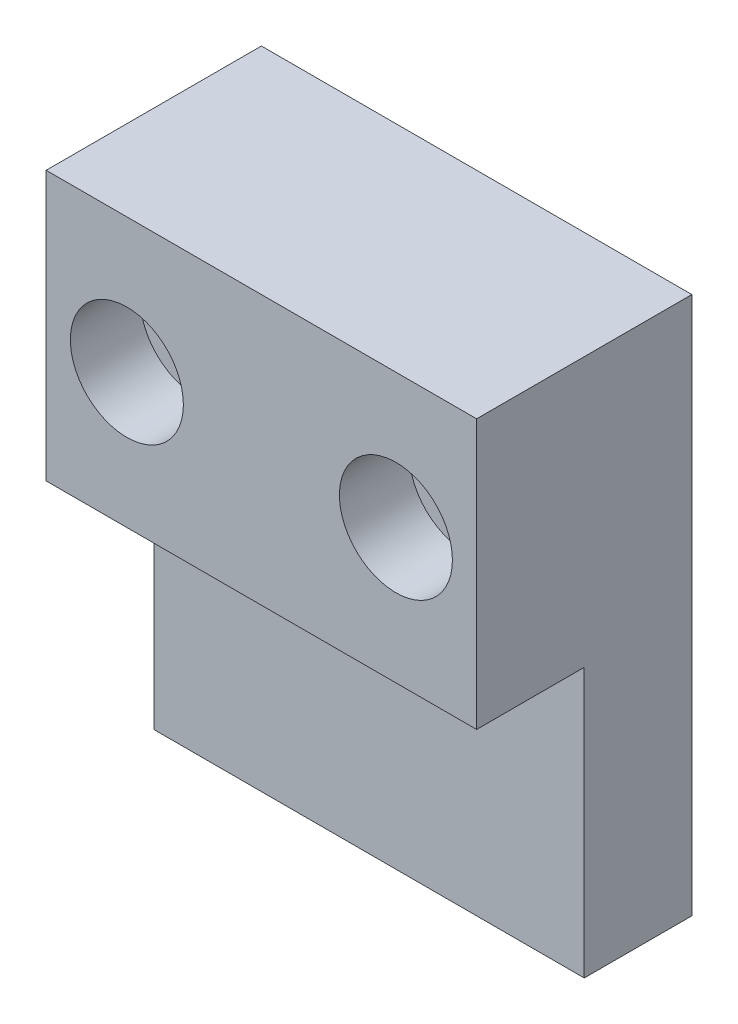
ISO-10303-21;
HEADER;
FILE_DESCRIPTION(('STEP AP214'),'2;1');
FILE_NAME('part.step','',(''),(''),'','','');
FILE_SCHEMA(('AUTOMOTIVE_DESIGN { 1 0 10303 214 1 1 1 1 }'));
ENDSEC;
DATA;
#1=APPLICATION_CONTEXT('core data for automotive mechanical design processes');
#2=APPLICATION_PROTOCOL_DEFINITION('international standard','automotive_design',2000,#1);
#3=PRODUCT_CONTEXT('',#1,'mechanical');
#4=PRODUCT('Part','Part','',(#3));
#5=PRODUCT_RELATED_PRODUCT_CATEGORY('part','',(#4));
#6=PRODUCT_DEFINITION_FORMATION('','',#4);
#7=PRODUCT_DEFINITION_CONTEXT('part definition',#1,'design');
#8=PRODUCT_DEFINITION('design','',#6,#7);
#9=PRODUCT_DEFINITION_SHAPE('','',#8);
#10=(LENGTH_UNIT() NAMED_UNIT(*) SI_UNIT(.MILLI.,.METRE.));
#11=(NAMED_UNIT(*) PLANE_ANGLE_UNIT() SI_UNIT($,.RADIAN.));
#12=(NAMED_UNIT(*) SI_UNIT($,.STERADIAN.) SOLID_ANGLE_UNIT());
#13=UNCERTAINTY_MEASURE_WITH_UNIT(LENGTH_MEASURE(1.E-05),#10,'distance_accuracy_value','');
#14=(GEOMETRIC_REPRESENTATION_CONTEXT(3) GLOBAL_UNCERTAINTY_ASSIGNED_CONTEXT((#13)) GLOBAL_UNIT_ASSIGNED_CONTEXT((#10,
#11,#12)) REPRESENTATION_CONTEXT('',''));
#15=CARTESIAN_POINT('',(0.,0.,0.));
#16=DIRECTION('',(0.,0.,1.));
#17=DIRECTION('',(1.,0.,0.));
#18=AXIS2_PLACEMENT_3D('',#15,#16,#17);
#19=CARTESIAN_POINT('',(7.5,37.5,20.));
#20=DIRECTION('',(0.,0.,1.));
#21=DIRECTION('',(1.,0.,0.));
#22=AXIS2_PLACEMENT_3D('',#19,#20,#21);
#23=CYLINDRICAL_SURFACE('',#22,3.25);
#24=CARTESIAN_POINT('',(7.5,37.5,13.5));
#25=DIRECTION('',(0.,0.,1.));
#26=DIRECTION('',(1.,0.,0.));
#27=AXIS2_PLACEMENT_3D('',#24,#25,#26);
#28=CIRCLE('',#27,3.25);
#29=CARTESIAN_POINT('',(10.75,37.5,13.5));
#30=VERTEX_POINT('',#29);
#31=EDGE_CURVE('E110',#30,#30,#28,.T.);
#32=ORIENTED_EDGE('',*,*,#31,.T.);
#33=EDGE_LOOP('',(#32));
#34=FACE_BOUND('',#33,.T.);
#35=CARTESIAN_POINT('',(7.5,37.5,5.));
#36=DIRECTION('',(0.,0.,-1.));
#37=DIRECTION('',(-1.,0.,0.));
#38=AXIS2_PLACEMENT_3D('',#35,#36,#37);
#39=CIRCLE('',#38,3.25);
#40=CARTESIAN_POINT('',(4.25,37.5,5.));
#41=VERTEX_POINT('',#40);
#42=EDGE_CURVE('E35',#41,#41,#39,.F.);
#43=ORIENTED_EDGE('',*,*,#42,.F.);
#44=EDGE_LOOP('',(#43));
#45=FACE_BOUND('',#44,.T.);
#46=ADVANCED_FACE('F31',(#34,#45),#23,.F.);
#47=CARTESIAN_POINT('',(32.5,37.5,20.));
#48=DIRECTION('',(0.,0.,1.));
#49=DIRECTION('',(1.,0.,0.));
#50=AXIS2_PLACEMENT_3D('',#47,#48,#49);
#51=CYLINDRICAL_SURFACE('',#50,3.25);
#52=CARTESIAN_POINT('',(32.5,37.5,13.5));
#53=DIRECTION('',(0.,0.,1.));
#54=DIRECTION('',(1.,0.,0.));
#55=AXIS2_PLACEMENT_3D('',#52,#53,#54);
#56=CIRCLE('',#55,3.25);
#57=CARTESIAN_POINT('',(35.75,37.5,13.5));
#58=VERTEX_POINT('',#57);
#59=EDGE_CURVE('E133',#58,#58,#56,.T.);
#60=ORIENTED_EDGE('',*,*,#59,.T.);
#61=EDGE_LOOP('',(#60));
#62=FACE_BOUND('',#61,.T.);
#63=CARTESIAN_POINT('',(32.5,37.5,5.));
#64=DIRECTION('',(0.,0.,-1.));
#65=DIRECTION('',(-1.,0.,0.));
#66=AXIS2_PLACEMENT_3D('',#63,#64,#65);
#67=CIRCLE('',#66,3.25);
#68=CARTESIAN_POINT('',(29.25,37.5,5.));
#69=VERTEX_POINT('',#68);
#70=EDGE_CURVE('E108',#69,#69,#67,.F.);
#71=ORIENTED_EDGE('',*,*,#70,.F.);
#72=EDGE_LOOP('',(#71));
#73=FACE_BOUND('',#72,.T.);
#74=ADVANCED_FACE('F191',(#62,#73),#51,.F.);
#75=CARTESIAN_POINT('',(0.,0.,20.));
#76=DIRECTION('',(1.,0.,0.));
#77=DIRECTION('',(0.,0.,-1.));
#78=AXIS2_PLACEMENT_3D('',#75,#76,#77);
#79=PLANE('',#78);
#80=DIRECTION('',(0.,-1.,0.));
#81=VECTOR('',#80,1.);
#82=CARTESIAN_POINT('',(0.,0.,10.));
#83=LINE('',#82,#81);
#84=CARTESIAN_POINT('',(0.,25.,10.));
#85=VERTEX_POINT('',#84);
#86=CARTESIAN_POINT('',(0.,0.,10.));
#87=VERTEX_POINT('',#86);
#88=EDGE_CURVE('E143',#85,#87,#83,.T.);
#89=ORIENTED_EDGE('',*,*,#88,.F.);
#90=DIRECTION('',(0.,0.,1.));
#91=VECTOR('',#90,1.);
#92=CARTESIAN_POINT('',(0.,25.,10.));
#93=LINE('',#92,#91);
#94=CARTESIAN_POINT('',(0.,25.,20.));
#95=VERTEX_POINT('',#94);
#96=EDGE_CURVE('E99',#85,#95,#93,.T.);
#97=ORIENTED_EDGE('',*,*,#96,.T.);
#98=DIRECTION('',(0.,-1.,0.));
#99=VECTOR('',#98,1.);
#100=CARTESIAN_POINT('',(0.,0.,20.));
#101=LINE('',#100,#99);
#102=CARTESIAN_POINT('',(0.,50.,20.));
#103=VERTEX_POINT('',#102);
#104=EDGE_CURVE('E85',#103,#95,#101,.T.);
#105=ORIENTED_EDGE('',*,*,#104,.F.);
#106=DIRECTION('',(0.,0.,-1.));
#107=VECTOR('',#106,1.);
#108=CARTESIAN_POINT('',(0.,50.,20.));
#109=LINE('',#108,#107);
#110=CARTESIAN_POINT('',(0.,50.,0.));
#111=VERTEX_POINT('',#110);
#112=EDGE_CURVE('E78',#103,#111,#109,.T.);
#113=ORIENTED_EDGE('',*,*,#112,.T.);
#114=DIRECTION('',(0.,-1.,0.));
#115=VECTOR('',#114,1.);
#116=CARTESIAN_POINT('',(0.,0.,0.));
#117=LINE('',#116,#115);
#118=CARTESIAN_POINT('',(0.,0.,0.));
#119=VERTEX_POINT('',#118);
#120=EDGE_CURVE('E92',#111,#119,#117,.T.);
#121=ORIENTED_EDGE('',*,*,#120,.T.);
#122=DIRECTION('',(0.,0.,-1.));
#123=VECTOR('',#122,1.);
#124=CARTESIAN_POINT('',(0.,0.,20.));
#125=LINE('',#124,#123);
#126=EDGE_CURVE('E11',#87,#119,#125,.T.);
#127=ORIENTED_EDGE('',*,*,#126,.F.);
#128=EDGE_LOOP('',(#89,#97,#105,#113,#121,#127));
#129=FACE_BOUND('',#128,.T.);
#130=ADVANCED_FACE('F33',(#129),#79,.F.);
#131=CARTESIAN_POINT('',(0.,0.,20.));
#132=DIRECTION('',(0.,1.,0.));
#133=DIRECTION('',(0.,0.,1.));
#134=AXIS2_PLACEMENT_3D('',#131,#132,#133);
#135=PLANE('',#134);
#136=DIRECTION('',(0.,0.,-1.));
#137=VECTOR('',#136,1.);
#138=CARTESIAN_POINT('',(40.,0.,20.));
#139=LINE('',#138,#137);
#140=CARTESIAN_POINT('',(40.,0.,10.));
#141=VERTEX_POINT('',#140);
#142=CARTESIAN_POINT('',(40.,0.,0.));
#143=VERTEX_POINT('',#142);
#144=EDGE_CURVE('E40',#141,#143,#139,.T.);
#145=ORIENTED_EDGE('',*,*,#144,.F.);
#146=DIRECTION('',(1.,0.,0.));
#147=VECTOR('',#146,1.);
#148=CARTESIAN_POINT('',(0.,0.,10.));
#149=LINE('',#148,#147);
#150=EDGE_CURVE('E146',#87,#141,#149,.T.);
#151=ORIENTED_EDGE('',*,*,#150,.F.);
#152=ORIENTED_EDGE('',*,*,#126,.T.);
#153=DIRECTION('',(1.,0.,0.));
#154=VECTOR('',#153,1.);
#155=CARTESIAN_POINT('',(0.,0.,0.));
#156=LINE('',#155,#154);
#157=EDGE_CURVE('E98',#119,#143,#156,.T.);
#158=ORIENTED_EDGE('',*,*,#157,.T.);
#159=EDGE_LOOP('',(#145,#151,#152,#158));
#160=FACE_BOUND('',#159,.T.);
#161=ADVANCED_FACE('F167',(#160),#135,.F.);
#162=CARTESIAN_POINT('',(40.,0.,20.));
#163=DIRECTION('',(-1.,0.,0.));
#164=DIRECTION('',(0.,0.,1.));
#165=AXIS2_PLACEMENT_3D('',#162,#163,#164);
#166=PLANE('',#165);
#167=DIRECTION('',(0.,1.,0.));
#168=VECTOR('',#167,1.);
#169=CARTESIAN_POINT('',(40.,0.,20.));
#170=LINE('',#169,#168);
#171=CARTESIAN_POINT('',(40.,25.,20.));
#172=VERTEX_POINT('',#171);
#173=CARTESIAN_POINT('',(40.,50.,20.));
#174=VERTEX_POINT('',#173);
#175=EDGE_CURVE('E157',#172,#174,#170,.T.);
#176=ORIENTED_EDGE('',*,*,#175,.F.);
#177=DIRECTION('',(0.,0.,1.));
#178=VECTOR('',#177,1.);
#179=CARTESIAN_POINT('',(40.,25.,10.));
#180=LINE('',#179,#178);
#181=CARTESIAN_POINT('',(40.,25.,10.));
#182=VERTEX_POINT('',#181);
#183=EDGE_CURVE('E48',#182,#172,#180,.T.);
#184=ORIENTED_EDGE('',*,*,#183,.F.);
#185=DIRECTION('',(0.,1.,0.));
#186=VECTOR('',#185,1.);
#187=CARTESIAN_POINT('',(40.,0.,10.));
#188=LINE('',#187,#186);
#189=EDGE_CURVE('E149',#141,#182,#188,.T.);
#190=ORIENTED_EDGE('',*,*,#189,.F.);
#191=ORIENTED_EDGE('',*,*,#144,.T.);
#192=DIRECTION('',(0.,1.,0.));
#193=VECTOR('',#192,1.);
#194=CARTESIAN_POINT('',(40.,0.,0.));
#195=LINE('',#194,#193);
#196=CARTESIAN_POINT('',(40.,50.,0.));
#197=VERTEX_POINT('',#196);
#198=EDGE_CURVE('E86',#143,#197,#195,.T.);
#199=ORIENTED_EDGE('',*,*,#198,.T.);
#200=DIRECTION('',(0.,0.,-1.));
#201=VECTOR('',#200,1.);
#202=CARTESIAN_POINT('',(40.,50.,20.));
#203=LINE('',#202,#201);
#204=EDGE_CURVE('E81',#174,#197,#203,.T.);
#205=ORIENTED_EDGE('',*,*,#204,.F.);
#206=EDGE_LOOP('',(#176,#184,#190,#191,#199,#205));
#207=FACE_BOUND('',#206,.T.);
#208=ADVANCED_FACE('F161',(#207),#166,.F.);
#209=CARTESIAN_POINT('',(0.,50.,20.));
#210=DIRECTION('',(0.,-1.,0.));
#211=DIRECTION('',(0.,0.,-1.));
#212=AXIS2_PLACEMENT_3D('',#209,#210,#211);
#213=PLANE('',#212);
#214=DIRECTION('',(-1.,0.,0.));
#215=VECTOR('',#214,1.);
#216=CARTESIAN_POINT('',(0.,50.,0.));
#217=LINE('',#216,#215);
#218=EDGE_CURVE('E75',#197,#111,#217,.T.);
#219=ORIENTED_EDGE('',*,*,#218,.T.);
#220=ORIENTED_EDGE('',*,*,#112,.F.);
#221=DIRECTION('',(-1.,0.,0.));
#222=VECTOR('',#221,1.);
#223=CARTESIAN_POINT('',(0.,50.,20.));
#224=LINE('',#223,#222);
#225=EDGE_CURVE('E57',#174,#103,#224,.T.);
#226=ORIENTED_EDGE('',*,*,#225,.F.);
#227=ORIENTED_EDGE('',*,*,#204,.T.);
#228=EDGE_LOOP('',(#219,#220,#226,#227));
#229=FACE_BOUND('',#228,.T.);
#230=ADVANCED_FACE('F77',(#229),#213,.F.);
#231=CARTESIAN_POINT('',(0.,50.,20.));
#232=DIRECTION('',(0.,0.,-1.));
#233=DIRECTION('',(-1.,0.,0.));
#234=AXIS2_PLACEMENT_3D('',#231,#232,#233);
#235=PLANE('',#234);
#236=CARTESIAN_POINT('',(7.5,37.5,20.));
#237=DIRECTION('',(0.,0.,1.));
#238=DIRECTION('',(1.,0.,0.));
#239=AXIS2_PLACEMENT_3D('',#236,#237,#238);
#240=CIRCLE('',#239,5.25);
#241=CARTESIAN_POINT('',(12.75,37.5,20.));
#242=VERTEX_POINT('',#241);
#243=EDGE_CURVE('E130',#242,#242,#240,.T.);
#244=ORIENTED_EDGE('',*,*,#243,.F.);
#245=EDGE_LOOP('',(#244));
#246=FACE_BOUND('',#245,.T.);
#247=CARTESIAN_POINT('',(32.5,37.5,20.));
#248=DIRECTION('',(0.,0.,1.));
#249=DIRECTION('',(1.,0.,0.));
#250=AXIS2_PLACEMENT_3D('',#247,#248,#249);
#251=CIRCLE('',#250,5.25);
#252=CARTESIAN_POINT('',(37.75,37.5,20.));
#253=VERTEX_POINT('',#252);
#254=EDGE_CURVE('E139',#253,#253,#251,.T.);
#255=ORIENTED_EDGE('',*,*,#254,.F.);
#256=EDGE_LOOP('',(#255));
#257=FACE_BOUND('',#256,.T.);
#258=ORIENTED_EDGE('',*,*,#104,.T.);
#259=DIRECTION('',(-1.,0.,0.));
#260=VECTOR('',#259,1.);
#261=CARTESIAN_POINT('',(0.,25.,20.));
#262=LINE('',#261,#260);
#263=EDGE_CURVE('E142',#172,#95,#262,.T.);
#264=ORIENTED_EDGE('',*,*,#263,.F.);
#265=ORIENTED_EDGE('',*,*,#175,.T.);
#266=ORIENTED_EDGE('',*,*,#225,.T.);
#267=EDGE_LOOP('',(#258,#264,#265,#266));
#268=FACE_BOUND('',#267,.T.);
#269=ADVANCED_FACE('F159',(#246,#257,#268),#235,.F.);
#270=CARTESIAN_POINT('',(0.,50.,0.));
#271=DIRECTION('',(0.,0.,-1.));
#272=DIRECTION('',(-1.,0.,0.));
#273=AXIS2_PLACEMENT_3D('',#270,#271,#272);
#274=PLANE('',#273);
#275=CARTESIAN_POINT('',(7.5,37.5,0.));
#276=DIRECTION('',(0.,0.,-1.));
#277=DIRECTION('',(-1.,0.,0.));
#278=AXIS2_PLACEMENT_3D('',#275,#276,#277);
#279=CIRCLE('',#278,6.);
#280=CARTESIAN_POINT('',(1.5,37.5,0.));
#281=VERTEX_POINT('',#280);
#282=EDGE_CURVE('E125',#281,#281,#279,.T.);
#283=ORIENTED_EDGE('',*,*,#282,.F.);
#284=EDGE_LOOP('',(#283));
#285=FACE_BOUND('',#284,.T.);
#286=CARTESIAN_POINT('',(32.5,37.5,0.));
#287=DIRECTION('',(0.,0.,-1.));
#288=DIRECTION('',(-1.,0.,0.));
#289=AXIS2_PLACEMENT_3D('',#286,#287,#288);
#290=CIRCLE('',#289,6.);
#291=CARTESIAN_POINT('',(26.5,37.5,0.));
#292=VERTEX_POINT('',#291);
#293=EDGE_CURVE('E118',#292,#292,#290,.T.);
#294=ORIENTED_EDGE('',*,*,#293,.F.);
#295=EDGE_LOOP('',(#294));
#296=FACE_BOUND('',#295,.T.);
#297=ORIENTED_EDGE('',*,*,#120,.F.);
#298=ORIENTED_EDGE('',*,*,#218,.F.);
#299=ORIENTED_EDGE('',*,*,#198,.F.);
#300=ORIENTED_EDGE('',*,*,#157,.F.);
#301=EDGE_LOOP('',(#297,#298,#299,#300));
#302=FACE_BOUND('',#301,.T.);
#303=ADVANCED_FACE('F96',(#285,#296,#302),#274,.T.);
#304=CARTESIAN_POINT('',(0.,25.,10.));
#305=DIRECTION('',(0.,1.,0.));
#306=DIRECTION('',(0.,0.,1.));
#307=AXIS2_PLACEMENT_3D('',#304,#305,#306);
#308=PLANE('',#307);
#309=ORIENTED_EDGE('',*,*,#263,.T.);
#310=ORIENTED_EDGE('',*,*,#96,.F.);
#311=DIRECTION('',(-1.,0.,0.));
#312=VECTOR('',#311,1.);
#313=CARTESIAN_POINT('',(0.,25.,10.));
#314=LINE('',#313,#312);
#315=EDGE_CURVE('E152',#182,#85,#314,.T.);
#316=ORIENTED_EDGE('',*,*,#315,.F.);
#317=ORIENTED_EDGE('',*,*,#183,.T.);
#318=EDGE_LOOP('',(#309,#310,#316,#317));
#319=FACE_BOUND('',#318,.T.);
#320=ADVANCED_FACE('F177',(#319),#308,.F.);
#321=CARTESIAN_POINT('',(0.,25.,10.));
#322=DIRECTION('',(0.,0.,-1.));
#323=DIRECTION('',(-1.,0.,0.));
#324=AXIS2_PLACEMENT_3D('',#321,#322,#323);
#325=PLANE('',#324);
#326=ORIENTED_EDGE('',*,*,#88,.T.);
#327=ORIENTED_EDGE('',*,*,#150,.T.);
#328=ORIENTED_EDGE('',*,*,#189,.T.);
#329=ORIENTED_EDGE('',*,*,#315,.T.);
#330=EDGE_LOOP('',(#326,#327,#328,#329));
#331=FACE_BOUND('',#330,.T.);
#332=ADVANCED_FACE('F178',(#331),#325,.F.);
#333=CARTESIAN_POINT('',(32.5,37.5,20.));
#334=DIRECTION('',(0.,0.,1.));
#335=DIRECTION('',(1.,0.,0.));
#336=AXIS2_PLACEMENT_3D('',#333,#334,#335);
#337=CYLINDRICAL_SURFACE('',#336,5.25);
#338=CARTESIAN_POINT('',(32.5,37.5,13.5));
#339=DIRECTION('',(0.,0.,1.));
#340=DIRECTION('',(1.,0.,0.));
#341=AXIS2_PLACEMENT_3D('',#338,#339,#340);
#342=CIRCLE('',#341,5.25);
#343=CARTESIAN_POINT('',(37.75,37.5,13.5));
#344=VERTEX_POINT('',#343);
#345=EDGE_CURVE('E136',#344,#344,#342,.T.);
#346=ORIENTED_EDGE('',*,*,#345,.F.);
#347=EDGE_LOOP('',(#346));
#348=FACE_BOUND('',#347,.T.);
#349=ORIENTED_EDGE('',*,*,#254,.T.);
#350=EDGE_LOOP('',(#349));
#351=FACE_BOUND('',#350,.T.);
#352=ADVANCED_FACE('F180',(#348,#351),#337,.F.);
#353=CARTESIAN_POINT('',(35.75,37.5,13.5));
#354=DIRECTION('',(0.,0.,-1.));
#355=DIRECTION('',(-1.,0.,0.));
#356=AXIS2_PLACEMENT_3D('',#353,#354,#355);
#357=PLANE('',#356);
#358=ORIENTED_EDGE('',*,*,#59,.F.);
#359=EDGE_LOOP('',(#358));
#360=FACE_BOUND('',#359,.T.);
#361=ORIENTED_EDGE('',*,*,#345,.T.);
#362=EDGE_LOOP('',(#361));
#363=FACE_BOUND('',#362,.T.);
#364=ADVANCED_FACE('F186',(#360,#363),#357,.F.);
#365=CARTESIAN_POINT('',(7.5,37.5,20.));
#366=DIRECTION('',(0.,0.,1.));
#367=DIRECTION('',(1.,0.,0.));
#368=AXIS2_PLACEMENT_3D('',#365,#366,#367);
#369=CYLINDRICAL_SURFACE('',#368,5.25);
#370=CARTESIAN_POINT('',(7.5,37.5,13.5));
#371=DIRECTION('',(0.,0.,1.));
#372=DIRECTION('',(1.,0.,0.));
#373=AXIS2_PLACEMENT_3D('',#370,#371,#372);
#374=CIRCLE('',#373,5.25);
#375=CARTESIAN_POINT('',(12.75,37.5,13.5));
#376=VERTEX_POINT('',#375);
#377=EDGE_CURVE('E115',#376,#376,#374,.T.);
#378=ORIENTED_EDGE('',*,*,#377,.F.);
#379=EDGE_LOOP('',(#378));
#380=FACE_BOUND('',#379,.T.);
#381=ORIENTED_EDGE('',*,*,#243,.T.);
#382=EDGE_LOOP('',(#381));
#383=FACE_BOUND('',#382,.T.);
#384=ADVANCED_FACE('F208',(#380,#383),#369,.F.);
#385=CARTESIAN_POINT('',(10.75,37.5,13.5));
#386=DIRECTION('',(0.,0.,-1.));
#387=DIRECTION('',(-1.,0.,0.));
#388=AXIS2_PLACEMENT_3D('',#385,#386,#387);
#389=PLANE('',#388);
#390=ORIENTED_EDGE('',*,*,#31,.F.);
#391=EDGE_LOOP('',(#390));
#392=FACE_BOUND('',#391,.T.);
#393=ORIENTED_EDGE('',*,*,#377,.T.);
#394=EDGE_LOOP('',(#393));
#395=FACE_BOUND('',#394,.T.);
#396=ADVANCED_FACE('F204',(#392,#395),#389,.F.);
#397=CARTESIAN_POINT('',(32.5,37.5,5.));
#398=DIRECTION('',(0.,0.,-1.));
#399=DIRECTION('',(-1.,0.,0.));
#400=AXIS2_PLACEMENT_3D('',#397,#398,#399);
#401=PLANE('',#400);
#402=CARTESIAN_POINT('',(32.5,37.5,5.));
#403=DIRECTION('',(0.,0.,-1.));
#404=DIRECTION('',(-1.,0.,0.));
#405=AXIS2_PLACEMENT_3D('',#402,#403,#404);
#406=CIRCLE('',#405,6.);
#407=CARTESIAN_POINT('',(26.5,37.5,5.));
#408=VERTEX_POINT('',#407);
#409=EDGE_CURVE('E111',#408,#408,#406,.T.);
#410=ORIENTED_EDGE('',*,*,#409,.T.);
#411=EDGE_LOOP('',(#410));
#412=FACE_BOUND('',#411,.T.);
#413=ORIENTED_EDGE('',*,*,#70,.T.);
#414=EDGE_LOOP('',(#413));
#415=FACE_BOUND('',#414,.T.);
#416=ADVANCED_FACE('F207',(#412,#415),#401,.T.);
#417=CARTESIAN_POINT('',(32.5,37.5,5.));
#418=DIRECTION('',(0.,0.,-1.));
#419=DIRECTION('',(-1.,0.,0.));
#420=AXIS2_PLACEMENT_3D('',#417,#418,#419);
#421=CYLINDRICAL_SURFACE('',#420,6.);
#422=ORIENTED_EDGE('',*,*,#409,.F.);
#423=EDGE_LOOP('',(#422));
#424=FACE_BOUND('',#423,.T.);
#425=ORIENTED_EDGE('',*,*,#293,.T.);
#426=EDGE_LOOP('',(#425));
#427=FACE_BOUND('',#426,.T.);
#428=ADVANCED_FACE('F202',(#424,#427),#421,.F.);
#429=CARTESIAN_POINT('',(7.5,37.5,5.));
#430=DIRECTION('',(0.,0.,-1.));
#431=DIRECTION('',(-1.,0.,0.));
#432=AXIS2_PLACEMENT_3D('',#429,#430,#431);
#433=PLANE('',#432);
#434=CARTESIAN_POINT('',(7.5,37.5,5.));
#435=DIRECTION('',(0.,0.,-1.));
#436=DIRECTION('',(-1.,0.,0.));
#437=AXIS2_PLACEMENT_3D('',#434,#435,#436);
#438=CIRCLE('',#437,6.);
#439=CARTESIAN_POINT('',(1.5,37.5,5.));
#440=VERTEX_POINT('',#439);
#441=EDGE_CURVE('E305',#440,#440,#438,.T.);
#442=ORIENTED_EDGE('',*,*,#441,.T.);
#443=EDGE_LOOP('',(#442));
#444=FACE_BOUND('',#443,.T.);
#445=ORIENTED_EDGE('',*,*,#42,.T.);
#446=EDGE_LOOP('',(#445));
#447=FACE_BOUND('',#446,.T.);
#448=ADVANCED_FACE('F266',(#444,#447),#433,.T.);
#449=CARTESIAN_POINT('',(7.5,37.5,5.));
#450=DIRECTION('',(0.,0.,-1.));
#451=DIRECTION('',(-1.,0.,0.));
#452=AXIS2_PLACEMENT_3D('',#449,#450,#451);
#453=CYLINDRICAL_SURFACE('',#452,6.);
#454=ORIENTED_EDGE('',*,*,#441,.F.);
#455=EDGE_LOOP('',(#454));
#456=FACE_BOUND('',#455,.T.);
#457=ORIENTED_EDGE('',*,*,#282,.T.);
#458=EDGE_LOOP('',(#457));
#459=FACE_BOUND('',#458,.T.);
#460=ADVANCED_FACE('F288',(#456,#459),#453,.F.);
#461=CLOSED_SHELL('',(#46,#74,#130,#161,#208,#230,#269,#303,#320,#332,#352,#364,#384,#396,#416,
#428,#448,#460));
#462=MANIFOLD_SOLID_BREP('B2',#461);
#463=ADVANCED_BREP_SHAPE_REPRESENTATION('',(#18,#462),#14);
#464=SHAPE_DEFINITION_REPRESENTATION(#9,#463);
ENDSEC;
END-ISO-10303-21;
